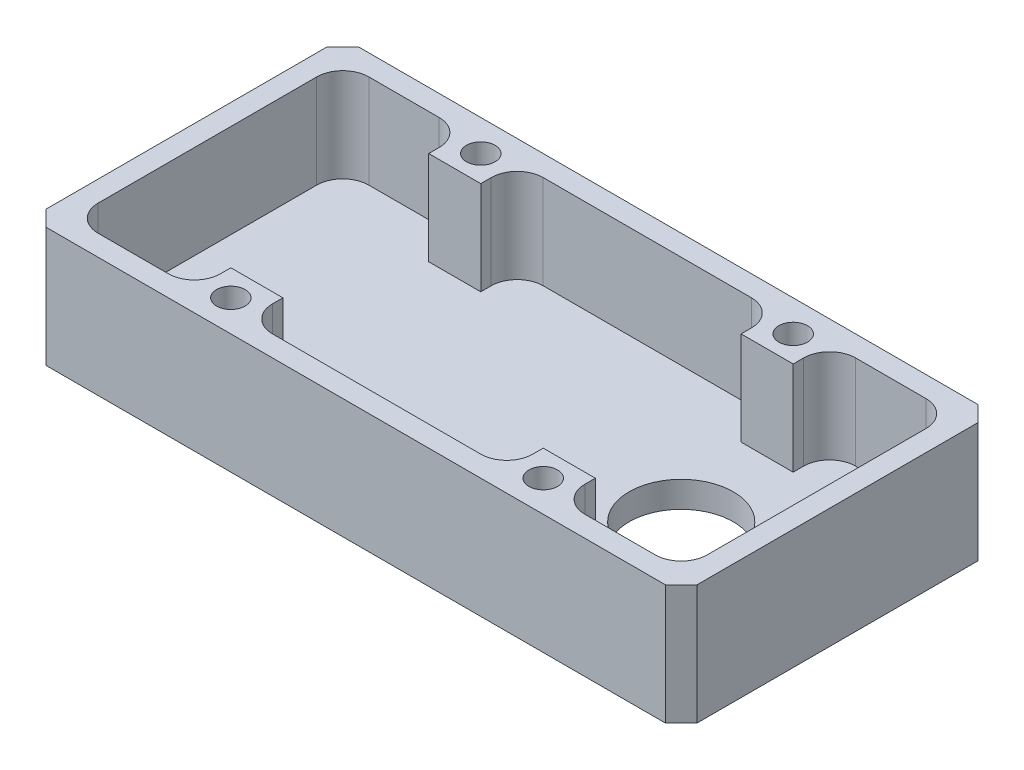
from build123d import *

# Parameters (mm, degrees)
SKETCH_1_W          = 125
SKETCH_1_H          = 60
EXTRUDE_1_DEPTH     = 23
CUT_EXTRUDE_1_DEPTH = 18
SKETCH_3_R          = 2.75
CUT_EXTRUDE_2_DEPTH = 74.042795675
SKETCH_4_R          = 10
CUT_EXTRUDE_3_DEPTH = 72.625763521
CHAMFER_1_SIZE      = 3


with BuildPart() as part:
    # Sketch 1 → Extrude 1 (new body)
    with BuildSketch(Plane(origin=(0, 0, 0), x_dir=(1, 0, 0), z_dir=(0, 1, 0))):
        Rectangle(SKETCH_1_W, SKETCH_1_H)
    extrude(amount=EXTRUDE_1_DEPTH)

    # Sketch 2 → Cut-Extrude 1 (cut)
    with BuildSketch(Plane(origin=(0, 23, 0), x_dir=(1, 0, 0), z_dir=(0, 1, 0))):
        with BuildLine():
            Line((-58.5, -21), (-58.5, 21))
            ThreePointArc((-58.5, 21), (-57.035533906, 24.535533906), (-53.5, 26))
            Line((-53.5, 26), (-40, 26))
            ThreePointArc((-40, 26), (-36.464466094, 24.535533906), (-35, 21))
            Line((-35, 21), (-35, 19))
            Line((-35, 19), (-25, 19))
            Line((-25, 19), (-25, 21))
            ThreePointArc((-25, 21), (-23.535533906, 24.535533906), (-20, 26))
            Line((-20, 26), (20, 26))
            ThreePointArc((20, 26), (23.535533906, 24.535533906), (25, 21))
            Line((25, 21), (25, 19))
            Line((25, 19), (35, 19))
            Line((35, 19), (35, 21))
            ThreePointArc((35, 21), (36.464466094, 24.535533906), (40, 26))
            Line((40, 26), (53.5, 26))
            ThreePointArc((53.5, 26), (57.035533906, 24.535533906), (58.5, 21))
            Line((58.5, 21), (58.5, -21))
            ThreePointArc((58.5, -21), (57.035533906, -24.535533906), (53.5, -26))
            Line((53.5, -26), (40, -26))
            ThreePointArc((40, -26), (36.464466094, -24.535533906), (35, -21))
            Line((35, -21), (35, -19))
            Line((35, -19), (25, -19))
            Line((25, -19), (25, -21))
            ThreePointArc((25, -21), (23.535533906, -24.535533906), (20, -26))
            Line((20, -26), (-20, -26))
            ThreePointArc((-20, -26), (-23.535533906, -24.535533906), (-25, -21))
            Line((-25, -21), (-25, -19))
            Line((-25, -19), (-35, -19))
            Line((-35, -19), (-35, -21))
            ThreePointArc((-35, -21), (-36.464466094, -24.535533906), (-40, -26))
            Line((-40, -26), (-53.5, -26))
            ThreePointArc((-53.5, -26), (-57.035533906, -24.535533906), (-58.5, -21))
        make_face()
    extrude(amount=-CUT_EXTRUDE_1_DEPTH, mode=Mode.SUBTRACT)

    # Sketch 3 → Cut-Extrude 2 (cut, through all)
    with BuildSketch(Plane(origin=(0, 23, 0), x_dir=(1, 0, 0), z_dir=(0, 1, 0))):
        with Locations(Location((-30, -24, 0), (0, 0, 270))):
            Circle(SKETCH_3_R)
        with Locations(Location((-30, 24, 0), (0, 0, 90))):
            Circle(SKETCH_3_R)
        with Locations(Location((30, -24, 0), (0, 0, 90))):
            Circle(SKETCH_3_R)
        with Locations(Location((30, 24, 0), (0, 0, 270))):
            Circle(SKETCH_3_R)
    extrude(amount=-CUT_EXTRUDE_2_DEPTH, mode=Mode.SUBTRACT)

    # Sketch 4 → Cut-Extrude 3 (cut, through all)
    with BuildSketch(Plane(origin=(0, 5, 0), x_dir=(1, 0, 0), z_dir=(0, 1, 0))):
        with Locations(Location((32.5, 0, 0), (0, 0, 270))):
            Circle(SKETCH_4_R)
    extrude(amount=-CUT_EXTRUDE_3_DEPTH, mode=Mode.SUBTRACT)

    # Chamfer 1
    chamfer_1_edges = [part.edges().sort_by_distance(p)[0] for p in [
        (-62.5, 11.5, -30),
        (62.5, 11.5, -30),
        (62.5, 11.5, 30),
        (-62.5, 11.5, 30),
    ]]
    chamfer(chamfer_1_edges, length=CHAMFER_1_SIZE)


solid = part.part
